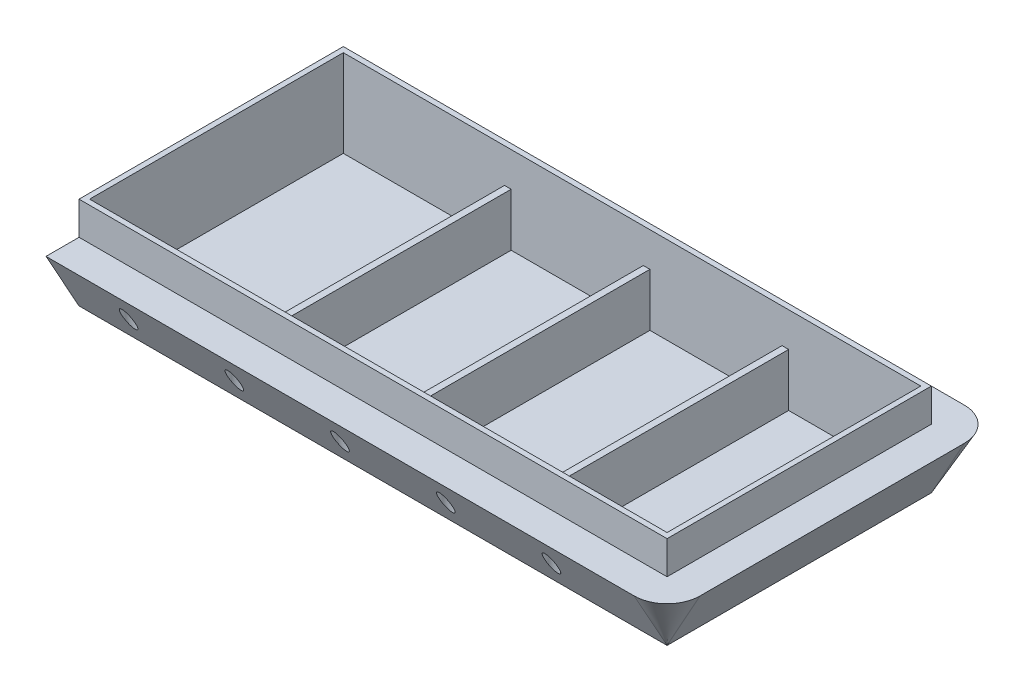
ISO-10303-21;
HEADER;
FILE_DESCRIPTION(('STEP AP214'),'2;1');
FILE_NAME('part.step','',(''),(''),'','','');
FILE_SCHEMA(('AUTOMOTIVE_DESIGN { 1 0 10303 214 1 1 1 1 }'));
ENDSEC;
DATA;
#1=APPLICATION_CONTEXT('core data for automotive mechanical design processes');
#2=APPLICATION_PROTOCOL_DEFINITION('international standard','automotive_design',2000,#1);
#3=PRODUCT_CONTEXT('',#1,'mechanical');
#4=PRODUCT('Part','Part','',(#3));
#5=PRODUCT_RELATED_PRODUCT_CATEGORY('part','',(#4));
#6=PRODUCT_DEFINITION_FORMATION('','',#4);
#7=PRODUCT_DEFINITION_CONTEXT('part definition',#1,'design');
#8=PRODUCT_DEFINITION('design','',#6,#7);
#9=PRODUCT_DEFINITION_SHAPE('','',#8);
#10=(LENGTH_UNIT() NAMED_UNIT(*) SI_UNIT(.MILLI.,.METRE.));
#11=(NAMED_UNIT(*) PLANE_ANGLE_UNIT() SI_UNIT($,.RADIAN.));
#12=(NAMED_UNIT(*) SI_UNIT($,.STERADIAN.) SOLID_ANGLE_UNIT());
#13=UNCERTAINTY_MEASURE_WITH_UNIT(LENGTH_MEASURE(1.E-05),#10,'distance_accuracy_value','');
#14=(GEOMETRIC_REPRESENTATION_CONTEXT(3) GLOBAL_UNCERTAINTY_ASSIGNED_CONTEXT((#13)) GLOBAL_UNIT_ASSIGNED_CONTEXT((#10,
#11,#12)) REPRESENTATION_CONTEXT('',''));
#15=CARTESIAN_POINT('',(0.,0.,0.));
#16=DIRECTION('',(0.,0.,1.));
#17=DIRECTION('',(1.,0.,0.));
#18=AXIS2_PLACEMENT_3D('',#15,#16,#17);
#19=CARTESIAN_POINT('',(-218.5,70.,-96.));
#20=DIRECTION('',(0.,0.,1.));
#21=DIRECTION('',(1.,0.,0.));
#22=AXIS2_PLACEMENT_3D('',#19,#20,#21);
#23=PLANE('',#22);
#24=DIRECTION('',(1.,0.,0.));
#25=VECTOR('',#24,1.);
#26=CARTESIAN_POINT('',(-218.5,4.,-96.));
#27=LINE('',#26,#25);
#28=CARTESIAN_POINT('',(-218.5,4.,-96.));
#29=VERTEX_POINT('',#28);
#30=CARTESIAN_POINT('',(-96.5000000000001,4.,-96.));
#31=VERTEX_POINT('',#30);
#32=EDGE_CURVE('E11',#29,#31,#27,.T.);
#33=ORIENTED_EDGE('',*,*,#32,.T.);
#34=DIRECTION('',(0.,-1.,0.));
#35=VECTOR('',#34,1.);
#36=CARTESIAN_POINT('',(-96.5000000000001,44.,-96.));
#37=LINE('',#36,#35);
#38=CARTESIAN_POINT('',(-96.5000000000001,44.,-96.));
#39=VERTEX_POINT('',#38);
#40=EDGE_CURVE('E61',#39,#31,#37,.T.);
#41=ORIENTED_EDGE('',*,*,#40,.F.);
#42=DIRECTION('',(-1.,0.,0.));
#43=VECTOR('',#42,1.);
#44=CARTESIAN_POINT('',(-96.5000000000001,44.,-96.));
#45=LINE('',#44,#43);
#46=CARTESIAN_POINT('',(-91.5,44.,-96.));
#47=VERTEX_POINT('',#46);
#48=EDGE_CURVE('E65',#47,#39,#45,.T.);
#49=ORIENTED_EDGE('',*,*,#48,.F.);
#50=DIRECTION('',(0.,-1.,0.));
#51=VECTOR('',#50,1.);
#52=CARTESIAN_POINT('',(-91.5000000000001,44.,-96.));
#53=LINE('',#52,#51);
#54=CARTESIAN_POINT('',(-91.5000000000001,4.,-96.));
#55=VERTEX_POINT('',#54);
#56=EDGE_CURVE('E222',#47,#55,#53,.T.);
#57=ORIENTED_EDGE('',*,*,#56,.T.);
#58=CARTESIAN_POINT('',(8.49999999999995,4.00000000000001,-96.));
#59=VERTEX_POINT('',#58);
#60=EDGE_CURVE('E53',#55,#59,#27,.T.);
#61=ORIENTED_EDGE('',*,*,#60,.T.);
#62=DIRECTION('',(0.,-1.,0.));
#63=VECTOR('',#62,1.);
#64=CARTESIAN_POINT('',(8.49999999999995,44.,-96.));
#65=LINE('',#64,#63);
#66=CARTESIAN_POINT('',(8.49999999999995,44.,-96.));
#67=VERTEX_POINT('',#66);
#68=EDGE_CURVE('E263',#67,#59,#65,.T.);
#69=ORIENTED_EDGE('',*,*,#68,.F.);
#70=DIRECTION('',(-1.,0.,0.));
#71=VECTOR('',#70,1.);
#72=CARTESIAN_POINT('',(8.49999999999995,44.,-96.));
#73=LINE('',#72,#71);
#74=CARTESIAN_POINT('',(13.5,44.,-96.));
#75=VERTEX_POINT('',#74);
#76=EDGE_CURVE('E266',#75,#67,#73,.T.);
#77=ORIENTED_EDGE('',*,*,#76,.F.);
#78=DIRECTION('',(0.,-1.,0.));
#79=VECTOR('',#78,1.);
#80=CARTESIAN_POINT('',(13.5,44.,-96.));
#81=LINE('',#80,#79);
#82=CARTESIAN_POINT('',(13.5,4.,-96.));
#83=VERTEX_POINT('',#82);
#84=EDGE_CURVE('E259',#75,#83,#81,.T.);
#85=ORIENTED_EDGE('',*,*,#84,.T.);
#86=CARTESIAN_POINT('',(113.5,4.00000000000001,-96.));
#87=VERTEX_POINT('',#86);
#88=EDGE_CURVE('E220',#83,#87,#27,.T.);
#89=ORIENTED_EDGE('',*,*,#88,.T.);
#90=DIRECTION('',(0.,-1.,0.));
#91=VECTOR('',#90,1.);
#92=CARTESIAN_POINT('',(113.5,44.,-96.));
#93=LINE('',#92,#91);
#94=CARTESIAN_POINT('',(113.5,44.,-96.));
#95=VERTEX_POINT('',#94);
#96=EDGE_CURVE('E306',#95,#87,#93,.T.);
#97=ORIENTED_EDGE('',*,*,#96,.F.);
#98=DIRECTION('',(-1.,0.,0.));
#99=VECTOR('',#98,1.);
#100=CARTESIAN_POINT('',(113.5,44.,-96.));
#101=LINE('',#100,#99);
#102=CARTESIAN_POINT('',(118.5,44.,-96.));
#103=VERTEX_POINT('',#102);
#104=EDGE_CURVE('E302',#103,#95,#101,.T.);
#105=ORIENTED_EDGE('',*,*,#104,.F.);
#106=DIRECTION('',(0.,-1.,0.));
#107=VECTOR('',#106,1.);
#108=CARTESIAN_POINT('',(118.5,44.,-96.));
#109=LINE('',#108,#107);
#110=CARTESIAN_POINT('',(118.5,4.,-96.));
#111=VERTEX_POINT('',#110);
#112=EDGE_CURVE('E316',#103,#111,#109,.T.);
#113=ORIENTED_EDGE('',*,*,#112,.T.);
#114=CARTESIAN_POINT('',(218.5,4.,-96.));
#115=VERTEX_POINT('',#114);
#116=EDGE_CURVE('E55',#111,#115,#27,.T.);
#117=ORIENTED_EDGE('',*,*,#116,.T.);
#118=DIRECTION('',(0.,-1.,0.));
#119=VECTOR('',#118,1.);
#120=CARTESIAN_POINT('',(218.5,70.,-96.));
#121=LINE('',#120,#119);
#122=CARTESIAN_POINT('',(218.5,70.,-96.));
#123=VERTEX_POINT('',#122);
#124=EDGE_CURVE('E457',#123,#115,#121,.T.);
#125=ORIENTED_EDGE('',*,*,#124,.F.);
#126=DIRECTION('',(-1.,0.,0.));
#127=VECTOR('',#126,1.);
#128=CARTESIAN_POINT('',(-218.5,70.,-96.));
#129=LINE('',#128,#127);
#130=CARTESIAN_POINT('',(-218.5,70.,-96.));
#131=VERTEX_POINT('',#130);
#132=EDGE_CURVE('E450',#123,#131,#129,.T.);
#133=ORIENTED_EDGE('',*,*,#132,.T.);
#134=DIRECTION('',(0.,-1.,0.));
#135=VECTOR('',#134,1.);
#136=CARTESIAN_POINT('',(-218.5,70.,-96.));
#137=LINE('',#136,#135);
#138=EDGE_CURVE('E453',#131,#29,#137,.T.);
#139=ORIENTED_EDGE('',*,*,#138,.T.);
#140=EDGE_LOOP('',(#33,#41,#49,#57,#61,#69,#77,#85,#89,#97,#105,#113,#117,#125,#133,#139));
#141=FACE_BOUND('',#140,.T.);
#142=ADVANCED_FACE('F43',(#141),#23,.T.);
#143=CARTESIAN_POINT('',(-218.5,70.,96.));
#144=DIRECTION('',(0.,0.,-1.));
#145=DIRECTION('',(-1.,0.,0.));
#146=AXIS2_PLACEMENT_3D('',#143,#144,#145);
#147=PLANE('',#146);
#148=DIRECTION('',(1.,0.,0.));
#149=VECTOR('',#148,1.);
#150=CARTESIAN_POINT('',(-96.5,44.,96.));
#151=LINE('',#150,#149);
#152=CARTESIAN_POINT('',(-96.5000000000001,44.,96.));
#153=VERTEX_POINT('',#152);
#154=CARTESIAN_POINT('',(-91.5,44.,96.));
#155=VERTEX_POINT('',#154);
#156=EDGE_CURVE('E240',#153,#155,#151,.T.);
#157=ORIENTED_EDGE('',*,*,#156,.F.);
#158=DIRECTION('',(0.,-1.,0.));
#159=VECTOR('',#158,1.);
#160=CARTESIAN_POINT('',(-96.5,44.,96.));
#161=LINE('',#160,#159);
#162=CARTESIAN_POINT('',(-96.5,4.,96.));
#163=VERTEX_POINT('',#162);
#164=EDGE_CURVE('E866',#153,#163,#161,.T.);
#165=ORIENTED_EDGE('',*,*,#164,.T.);
#166=DIRECTION('',(1.,0.,0.));
#167=VECTOR('',#166,1.);
#168=CARTESIAN_POINT('',(-222.5,4.,96.));
#169=LINE('',#168,#167);
#170=CARTESIAN_POINT('',(-218.5,4.,96.));
#171=VERTEX_POINT('',#170);
#172=EDGE_CURVE('E427',#171,#163,#169,.T.);
#173=ORIENTED_EDGE('',*,*,#172,.F.);
#174=DIRECTION('',(0.,-1.,0.));
#175=VECTOR('',#174,1.);
#176=CARTESIAN_POINT('',(-218.5,70.,96.));
#177=LINE('',#176,#175);
#178=CARTESIAN_POINT('',(-218.5,70.,96.));
#179=VERTEX_POINT('',#178);
#180=EDGE_CURVE('E465',#179,#171,#177,.T.);
#181=ORIENTED_EDGE('',*,*,#180,.F.);
#182=DIRECTION('',(1.,0.,0.));
#183=VECTOR('',#182,1.);
#184=CARTESIAN_POINT('',(-218.5,70.,96.));
#185=LINE('',#184,#183);
#186=CARTESIAN_POINT('',(218.5,70.,96.));
#187=VERTEX_POINT('',#186);
#188=EDGE_CURVE('E443',#179,#187,#185,.T.);
#189=ORIENTED_EDGE('',*,*,#188,.T.);
#190=DIRECTION('',(0.,-1.,0.));
#191=VECTOR('',#190,1.);
#192=CARTESIAN_POINT('',(218.5,70.,96.));
#193=LINE('',#192,#191);
#194=CARTESIAN_POINT('',(218.5,4.,96.));
#195=VERTEX_POINT('',#194);
#196=EDGE_CURVE('E461',#187,#195,#193,.T.);
#197=ORIENTED_EDGE('',*,*,#196,.T.);
#198=CARTESIAN_POINT('',(118.5,4.,96.));
#199=VERTEX_POINT('',#198);
#200=EDGE_CURVE('E426',#199,#195,#169,.T.);
#201=ORIENTED_EDGE('',*,*,#200,.F.);
#202=DIRECTION('',(0.,-1.,0.));
#203=VECTOR('',#202,1.);
#204=CARTESIAN_POINT('',(118.5,44.,96.));
#205=LINE('',#204,#203);
#206=CARTESIAN_POINT('',(118.5,44.,96.));
#207=VERTEX_POINT('',#206);
#208=EDGE_CURVE('E320',#207,#199,#205,.T.);
#209=ORIENTED_EDGE('',*,*,#208,.F.);
#210=DIRECTION('',(1.,0.,0.));
#211=VECTOR('',#210,1.);
#212=CARTESIAN_POINT('',(113.5,44.,96.));
#213=LINE('',#212,#211);
#214=CARTESIAN_POINT('',(113.5,44.,96.));
#215=VERTEX_POINT('',#214);
#216=EDGE_CURVE('E293',#215,#207,#213,.T.);
#217=ORIENTED_EDGE('',*,*,#216,.F.);
#218=DIRECTION('',(0.,-1.,0.));
#219=VECTOR('',#218,1.);
#220=CARTESIAN_POINT('',(113.5,44.,96.));
#221=LINE('',#220,#219);
#222=CARTESIAN_POINT('',(113.5,4.,96.));
#223=VERTEX_POINT('',#222);
#224=EDGE_CURVE('E324',#215,#223,#221,.T.);
#225=ORIENTED_EDGE('',*,*,#224,.T.);
#226=CARTESIAN_POINT('',(13.5,4.,96.));
#227=VERTEX_POINT('',#226);
#228=EDGE_CURVE('E628',#227,#223,#169,.T.);
#229=ORIENTED_EDGE('',*,*,#228,.F.);
#230=DIRECTION('',(0.,-1.,0.));
#231=VECTOR('',#230,1.);
#232=CARTESIAN_POINT('',(13.5,44.,96.));
#233=LINE('',#232,#231);
#234=CARTESIAN_POINT('',(13.5,44.,96.));
#235=VERTEX_POINT('',#234);
#236=EDGE_CURVE('E255',#235,#227,#233,.T.);
#237=ORIENTED_EDGE('',*,*,#236,.F.);
#238=DIRECTION('',(1.,0.,0.));
#239=VECTOR('',#238,1.);
#240=CARTESIAN_POINT('',(8.49999999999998,44.,96.));
#241=LINE('',#240,#239);
#242=CARTESIAN_POINT('',(8.49999999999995,44.,96.));
#243=VERTEX_POINT('',#242);
#244=EDGE_CURVE('E282',#243,#235,#241,.T.);
#245=ORIENTED_EDGE('',*,*,#244,.F.);
#246=DIRECTION('',(0.,-1.,0.));
#247=VECTOR('',#246,1.);
#248=CARTESIAN_POINT('',(8.49999999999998,44.,96.));
#249=LINE('',#248,#247);
#250=CARTESIAN_POINT('',(8.49999999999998,4.,96.));
#251=VERTEX_POINT('',#250);
#252=EDGE_CURVE('E237',#243,#251,#249,.T.);
#253=ORIENTED_EDGE('',*,*,#252,.T.);
#254=CARTESIAN_POINT('',(-91.5000000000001,4.,96.));
#255=VERTEX_POINT('',#254);
#256=EDGE_CURVE('E432',#255,#251,#169,.T.);
#257=ORIENTED_EDGE('',*,*,#256,.F.);
#258=DIRECTION('',(0.,-1.,0.));
#259=VECTOR('',#258,1.);
#260=CARTESIAN_POINT('',(-91.5,44.,96.));
#261=LINE('',#260,#259);
#262=EDGE_CURVE('E226',#155,#255,#261,.T.);
#263=ORIENTED_EDGE('',*,*,#262,.F.);
#264=EDGE_LOOP('',(#157,#165,#173,#181,#189,#197,#201,#209,#217,#225,#229,#237,#245,#253,#257,#263));
#265=FACE_BOUND('',#264,.T.);
#266=ADVANCED_FACE('F619',(#265),#147,.T.);
#267=CARTESIAN_POINT('',(-222.5,4.,541.017977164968));
#268=DIRECTION('',(0.,-1.,0.));
#269=DIRECTION('',(1.,0.,0.));
#270=AXIS2_PLACEMENT_3D('',#267,#268,#269);
#271=PLANE('',#270);
#272=DIRECTION('',(0.,0.,1.));
#273=VECTOR('',#272,1.);
#274=CARTESIAN_POINT('',(-96.5000000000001,4.,-96.));
#275=LINE('',#274,#273);
#276=EDGE_CURVE('E231',#31,#163,#275,.T.);
#277=ORIENTED_EDGE('',*,*,#276,.F.);
#278=ORIENTED_EDGE('',*,*,#32,.F.);
#279=DIRECTION('',(0.,0.,-1.));
#280=VECTOR('',#279,1.);
#281=CARTESIAN_POINT('',(-218.5,4.,-96.));
#282=LINE('',#281,#280);
#283=EDGE_CURVE('E436',#171,#29,#282,.T.);
#284=ORIENTED_EDGE('',*,*,#283,.F.);
#285=ORIENTED_EDGE('',*,*,#172,.T.);
#286=EDGE_LOOP('',(#277,#278,#284,#285));
#287=FACE_BOUND('',#286,.T.);
#288=ADVANCED_FACE('F670',(#287),#271,.F.);
#289=DIRECTION('',(0.,0.,-1.));
#290=VECTOR('',#289,1.);
#291=CARTESIAN_POINT('',(-91.5000000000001,4.,-96.));
#292=LINE('',#291,#290);
#293=EDGE_CURVE('E214',#255,#55,#292,.T.);
#294=ORIENTED_EDGE('',*,*,#293,.F.);
#295=ORIENTED_EDGE('',*,*,#256,.T.);
#296=DIRECTION('',(0.,0.,1.));
#297=VECTOR('',#296,1.);
#298=CARTESIAN_POINT('',(8.49999999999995,4.,-96.));
#299=LINE('',#298,#297);
#300=EDGE_CURVE('E217',#59,#251,#299,.T.);
#301=ORIENTED_EDGE('',*,*,#300,.F.);
#302=ORIENTED_EDGE('',*,*,#60,.F.);
#303=EDGE_LOOP('',(#294,#295,#301,#302));
#304=FACE_BOUND('',#303,.T.);
#305=ADVANCED_FACE('F212',(#304),#271,.F.);
#306=DIRECTION('',(0.,0.,-1.));
#307=VECTOR('',#306,1.);
#308=CARTESIAN_POINT('',(13.5,4.,-96.));
#309=LINE('',#308,#307);
#310=EDGE_CURVE('E267',#227,#83,#309,.T.);
#311=ORIENTED_EDGE('',*,*,#310,.F.);
#312=ORIENTED_EDGE('',*,*,#228,.T.);
#313=DIRECTION('',(0.,0.,1.));
#314=VECTOR('',#313,1.);
#315=CARTESIAN_POINT('',(113.5,4.,-96.));
#316=LINE('',#315,#314);
#317=EDGE_CURVE('E274',#87,#223,#316,.T.);
#318=ORIENTED_EDGE('',*,*,#317,.F.);
#319=ORIENTED_EDGE('',*,*,#88,.F.);
#320=EDGE_LOOP('',(#311,#312,#318,#319));
#321=FACE_BOUND('',#320,.T.);
#322=ADVANCED_FACE('F645',(#321),#271,.F.);
#323=DIRECTION('',(0.,0.,-1.));
#324=VECTOR('',#323,1.);
#325=CARTESIAN_POINT('',(118.5,4.,-96.));
#326=LINE('',#325,#324);
#327=EDGE_CURVE('E294',#199,#111,#326,.T.);
#328=ORIENTED_EDGE('',*,*,#327,.F.);
#329=ORIENTED_EDGE('',*,*,#200,.T.);
#330=DIRECTION('',(0.,0.,1.));
#331=VECTOR('',#330,1.);
#332=CARTESIAN_POINT('',(218.5,4.,-96.));
#333=LINE('',#332,#331);
#334=EDGE_CURVE('E431',#115,#195,#333,.T.);
#335=ORIENTED_EDGE('',*,*,#334,.F.);
#336=ORIENTED_EDGE('',*,*,#116,.F.);
#337=EDGE_LOOP('',(#328,#329,#335,#336));
#338=FACE_BOUND('',#337,.T.);
#339=ADVANCED_FACE('F626',(#338),#271,.F.);
#340=CARTESIAN_POINT('',(218.5,70.,-96.));
#341=DIRECTION('',(-1.,0.,0.));
#342=DIRECTION('',(0.,0.,1.));
#343=AXIS2_PLACEMENT_3D('',#340,#341,#342);
#344=PLANE('',#343);
#345=ORIENTED_EDGE('',*,*,#124,.T.);
#346=ORIENTED_EDGE('',*,*,#334,.T.);
#347=ORIENTED_EDGE('',*,*,#196,.F.);
#348=DIRECTION('',(0.,0.,-1.));
#349=VECTOR('',#348,1.);
#350=CARTESIAN_POINT('',(218.5,70.,-96.));
#351=LINE('',#350,#349);
#352=EDGE_CURVE('E446',#187,#123,#351,.T.);
#353=ORIENTED_EDGE('',*,*,#352,.T.);
#354=EDGE_LOOP('',(#345,#346,#347,#353));
#355=FACE_BOUND('',#354,.T.);
#356=ADVANCED_FACE('F623',(#355),#344,.T.);
#357=CARTESIAN_POINT('',(222.5,70.,-100.));
#358=DIRECTION('',(-1.,0.,0.));
#359=DIRECTION('',(0.,0.,1.));
#360=AXIS2_PLACEMENT_3D('',#357,#358,#359);
#361=PLANE('',#360);
#362=DIRECTION('',(0.,0.,1.));
#363=VECTOR('',#362,1.);
#364=CARTESIAN_POINT('',(222.5,45.,-151.478150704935));
#365=LINE('',#364,#363);
#366=CARTESIAN_POINT('',(222.5,45.,-100.));
#367=VERTEX_POINT('',#366);
#368=CARTESIAN_POINT('',(222.5,45.,100.));
#369=VERTEX_POINT('',#368);
#370=EDGE_CURVE('E342',#367,#369,#365,.T.);
#371=ORIENTED_EDGE('',*,*,#370,.F.);
#372=DIRECTION('',(0.,-1.,0.));
#373=VECTOR('',#372,1.);
#374=CARTESIAN_POINT('',(222.5,70.,-100.));
#375=LINE('',#374,#373);
#376=CARTESIAN_POINT('',(222.5,70.,-100.));
#377=VERTEX_POINT('',#376);
#378=EDGE_CURVE('E508',#377,#367,#375,.T.);
#379=ORIENTED_EDGE('',*,*,#378,.F.);
#380=DIRECTION('',(0.,0.,-1.));
#381=VECTOR('',#380,1.);
#382=CARTESIAN_POINT('',(222.5,70.,-100.));
#383=LINE('',#382,#381);
#384=CARTESIAN_POINT('',(222.5,70.,100.));
#385=VERTEX_POINT('',#384);
#386=EDGE_CURVE('E470',#385,#377,#383,.T.);
#387=ORIENTED_EDGE('',*,*,#386,.F.);
#388=DIRECTION('',(0.,-1.,0.));
#389=VECTOR('',#388,1.);
#390=CARTESIAN_POINT('',(222.5,70.,100.));
#391=LINE('',#390,#389);
#392=EDGE_CURVE('E484',#385,#369,#391,.T.);
#393=ORIENTED_EDGE('',*,*,#392,.T.);
#394=EDGE_LOOP('',(#371,#379,#387,#393));
#395=FACE_BOUND('',#394,.T.);
#396=ADVANCED_FACE('F45',(#395),#361,.F.);
#397=CARTESIAN_POINT('',(-222.5,70.,100.));
#398=DIRECTION('',(0.,0.,-1.));
#399=DIRECTION('',(-1.,0.,0.));
#400=AXIS2_PLACEMENT_3D('',#397,#398,#399);
#401=PLANE('',#400);
#402=DIRECTION('',(-1.,0.,0.));
#403=VECTOR('',#402,1.);
#404=CARTESIAN_POINT('',(273.978150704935,45.,100.));
#405=LINE('',#404,#403);
#406=CARTESIAN_POINT('',(-222.5,45.,100.));
#407=VERTEX_POINT('',#406);
#408=EDGE_CURVE('E417',#369,#407,#405,.T.);
#409=ORIENTED_EDGE('',*,*,#408,.F.);
#410=ORIENTED_EDGE('',*,*,#392,.F.);
#411=DIRECTION('',(1.,0.,0.));
#412=VECTOR('',#411,1.);
#413=CARTESIAN_POINT('',(-222.5,70.,100.));
#414=LINE('',#413,#412);
#415=CARTESIAN_POINT('',(-222.5,70.,100.));
#416=VERTEX_POINT('',#415);
#417=EDGE_CURVE('E481',#416,#385,#414,.T.);
#418=ORIENTED_EDGE('',*,*,#417,.F.);
#419=DIRECTION('',(0.,-1.,0.));
#420=VECTOR('',#419,1.);
#421=CARTESIAN_POINT('',(-222.5,70.,100.));
#422=LINE('',#421,#420);
#423=EDGE_CURVE('E500',#416,#407,#422,.T.);
#424=ORIENTED_EDGE('',*,*,#423,.T.);
#425=EDGE_LOOP('',(#409,#410,#418,#424));
#426=FACE_BOUND('',#425,.T.);
#427=ADVANCED_FACE('F604',(#426),#401,.F.);
#428=CARTESIAN_POINT('',(-218.5,70.,-96.));
#429=DIRECTION('',(1.,0.,0.));
#430=DIRECTION('',(0.,0.,-1.));
#431=AXIS2_PLACEMENT_3D('',#428,#429,#430);
#432=PLANE('',#431);
#433=ORIENTED_EDGE('',*,*,#180,.T.);
#434=ORIENTED_EDGE('',*,*,#283,.T.);
#435=ORIENTED_EDGE('',*,*,#138,.F.);
#436=DIRECTION('',(0.,0.,1.));
#437=VECTOR('',#436,1.);
#438=CARTESIAN_POINT('',(-218.5,70.,-96.));
#439=LINE('',#438,#437);
#440=EDGE_CURVE('E440',#131,#179,#439,.T.);
#441=ORIENTED_EDGE('',*,*,#440,.T.);
#442=EDGE_LOOP('',(#433,#434,#435,#441));
#443=FACE_BOUND('',#442,.T.);
#444=ADVANCED_FACE('F610',(#443),#432,.T.);
#445=CARTESIAN_POINT('',(0.,70.,0.));
#446=DIRECTION('',(0.,1.,0.));
#447=DIRECTION('',(0.,0.,1.));
#448=AXIS2_PLACEMENT_3D('',#445,#446,#447);
#449=PLANE('',#448);
#450=ORIENTED_EDGE('',*,*,#386,.T.);
#451=DIRECTION('',(-1.,0.,0.));
#452=VECTOR('',#451,1.);
#453=CARTESIAN_POINT('',(-222.5,70.,-100.));
#454=LINE('',#453,#452);
#455=CARTESIAN_POINT('',(-222.5,70.,-100.));
#456=VERTEX_POINT('',#455);
#457=EDGE_CURVE('E474',#377,#456,#454,.T.);
#458=ORIENTED_EDGE('',*,*,#457,.T.);
#459=DIRECTION('',(0.,0.,1.));
#460=VECTOR('',#459,1.);
#461=CARTESIAN_POINT('',(-222.5,70.,-100.));
#462=LINE('',#461,#460);
#463=EDGE_CURVE('E478',#456,#416,#462,.T.);
#464=ORIENTED_EDGE('',*,*,#463,.T.);
#465=ORIENTED_EDGE('',*,*,#417,.T.);
#466=EDGE_LOOP('',(#450,#458,#464,#465));
#467=FACE_BOUND('',#466,.T.);
#468=ORIENTED_EDGE('',*,*,#188,.F.);
#469=ORIENTED_EDGE('',*,*,#440,.F.);
#470=ORIENTED_EDGE('',*,*,#132,.F.);
#471=ORIENTED_EDGE('',*,*,#352,.F.);
#472=EDGE_LOOP('',(#468,#469,#470,#471));
#473=FACE_BOUND('',#472,.T.);
#474=ADVANCED_FACE('F607',(#467,#473),#449,.T.);
#475=CARTESIAN_POINT('',(0.,0.,0.));
#476=DIRECTION('',(0.,1.,0.));
#477=DIRECTION('',(0.,0.,1.));
#478=AXIS2_PLACEMENT_3D('',#475,#476,#477);
#479=PLANE('',#478);
#480=DIRECTION('',(1.,0.,0.));
#481=VECTOR('',#480,1.);
#482=CARTESIAN_POINT('',(-222.5,0.,100.));
#483=LINE('',#482,#481);
#484=CARTESIAN_POINT('',(-222.5,0.,100.));
#485=VERTEX_POINT('',#484);
#486=CARTESIAN_POINT('',(222.5,0.,100.));
#487=VERTEX_POINT('',#486);
#488=EDGE_CURVE('E475',#485,#487,#483,.T.);
#489=ORIENTED_EDGE('',*,*,#488,.F.);
#490=DIRECTION('',(0.,0.,1.));
#491=VECTOR('',#490,1.);
#492=CARTESIAN_POINT('',(-222.5,0.,-100.));
#493=LINE('',#492,#491);
#494=CARTESIAN_POINT('',(-222.5,0.,-100.));
#495=VERTEX_POINT('',#494);
#496=EDGE_CURVE('E491',#495,#485,#493,.T.);
#497=ORIENTED_EDGE('',*,*,#496,.F.);
#498=DIRECTION('',(-1.,0.,0.));
#499=VECTOR('',#498,1.);
#500=CARTESIAN_POINT('',(-222.5,0.,-100.));
#501=LINE('',#500,#499);
#502=CARTESIAN_POINT('',(222.5,0.,-100.));
#503=VERTEX_POINT('',#502);
#504=EDGE_CURVE('E488',#503,#495,#501,.T.);
#505=ORIENTED_EDGE('',*,*,#504,.F.);
#506=DIRECTION('',(0.,0.,-1.));
#507=VECTOR('',#506,1.);
#508=CARTESIAN_POINT('',(222.5,0.,-100.));
#509=LINE('',#508,#507);
#510=EDGE_CURVE('E469',#487,#503,#509,.T.);
#511=ORIENTED_EDGE('',*,*,#510,.F.);
#512=EDGE_LOOP('',(#489,#497,#505,#511));
#513=FACE_BOUND('',#512,.T.);
#514=ADVANCED_FACE('F588',(#513),#479,.F.);
#515=CARTESIAN_POINT('',(-222.5,70.,-100.));
#516=DIRECTION('',(0.,0.,1.));
#517=DIRECTION('',(1.,0.,0.));
#518=AXIS2_PLACEMENT_3D('',#515,#516,#517);
#519=PLANE('',#518);
#520=ORIENTED_EDGE('',*,*,#378,.T.);
#521=DIRECTION('',(-1.,0.,0.));
#522=VECTOR('',#521,1.);
#523=CARTESIAN_POINT('',(273.978150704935,45.,-100.));
#524=LINE('',#523,#522);
#525=CARTESIAN_POINT('',(-222.5,45.,-100.));
#526=VERTEX_POINT('',#525);
#527=EDGE_CURVE('E404',#367,#526,#524,.T.);
#528=ORIENTED_EDGE('',*,*,#527,.T.);
#529=DIRECTION('',(0.,-1.,0.));
#530=VECTOR('',#529,1.);
#531=CARTESIAN_POINT('',(-222.5,70.,-100.));
#532=LINE('',#531,#530);
#533=EDGE_CURVE('E504',#456,#526,#532,.T.);
#534=ORIENTED_EDGE('',*,*,#533,.F.);
#535=ORIENTED_EDGE('',*,*,#457,.F.);
#536=EDGE_LOOP('',(#520,#528,#534,#535));
#537=FACE_BOUND('',#536,.T.);
#538=ADVANCED_FACE('F599',(#537),#519,.F.);
#539=CARTESIAN_POINT('',(-222.5,70.,-100.));
#540=DIRECTION('',(1.,0.,0.));
#541=DIRECTION('',(0.,0.,-1.));
#542=AXIS2_PLACEMENT_3D('',#539,#540,#541);
#543=PLANE('',#542);
#544=ORIENTED_EDGE('',*,*,#496,.T.);
#545=DIRECTION('',(0.,0.874157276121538,0.485642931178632));
#546=VECTOR('',#545,1.);
#547=CARTESIAN_POINT('',(-222.5,45.,125.));
#548=LINE('',#547,#546);
#549=CARTESIAN_POINT('',(-222.5,45.,125.));
#550=VERTEX_POINT('',#549);
#551=EDGE_CURVE('E394',#485,#550,#548,.T.);
#552=ORIENTED_EDGE('',*,*,#551,.T.);
#553=DIRECTION('',(0.,0.,-1.));
#554=VECTOR('',#553,1.);
#555=CARTESIAN_POINT('',(-222.5,45.,100.));
#556=LINE('',#555,#554);
#557=EDGE_CURVE('E412',#550,#407,#556,.T.);
#558=ORIENTED_EDGE('',*,*,#557,.T.);
#559=ORIENTED_EDGE('',*,*,#423,.F.);
#560=ORIENTED_EDGE('',*,*,#463,.F.);
#561=ORIENTED_EDGE('',*,*,#533,.T.);
#562=DIRECTION('',(0.,0.,1.));
#563=VECTOR('',#562,1.);
#564=CARTESIAN_POINT('',(-222.5,45.,-100.));
#565=LINE('',#564,#563);
#566=CARTESIAN_POINT('',(-222.5,45.,-125.));
#567=VERTEX_POINT('',#566);
#568=EDGE_CURVE('E396',#567,#526,#565,.T.);
#569=ORIENTED_EDGE('',*,*,#568,.F.);
#570=DIRECTION('',(0.,0.874157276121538,-0.485642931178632));
#571=VECTOR('',#570,1.);
#572=CARTESIAN_POINT('',(-222.5,45.,-125.));
#573=LINE('',#572,#571);
#574=EDGE_CURVE('E400',#495,#567,#573,.T.);
#575=ORIENTED_EDGE('',*,*,#574,.F.);
#576=EDGE_LOOP('',(#544,#552,#558,#559,#560,#561,#569,#575));
#577=FACE_BOUND('',#576,.T.);
#578=ADVANCED_FACE('F580',(#577),#543,.F.);
#579=CARTESIAN_POINT('',(273.978150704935,45.,100.));
#580=DIRECTION('',(0.,1.,0.));
#581=DIRECTION('',(0.,0.,1.));
#582=AXIS2_PLACEMENT_3D('',#579,#580,#581);
#583=PLANE('',#582);
#584=DIRECTION('',(0.,0.,1.));
#585=VECTOR('',#584,1.);
#586=CARTESIAN_POINT('',(247.5,45.,-151.478150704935));
#587=LINE('',#586,#585);
#588=CARTESIAN_POINT('',(247.5,45.,-100.));
#589=VERTEX_POINT('',#588);
#590=CARTESIAN_POINT('',(247.5,45.,100.));
#591=VERTEX_POINT('',#590);
#592=EDGE_CURVE('E346',#589,#591,#587,.T.);
#593=ORIENTED_EDGE('',*,*,#592,.F.);
#594=CARTESIAN_POINT('',(222.5,45.,-100.));
#595=DIRECTION('',(0.,1.,0.));
#596=DIRECTION('',(0.,0.,1.));
#597=AXIS2_PLACEMENT_3D('',#594,#595,#596);
#598=CIRCLE('',#597,25.);
#599=CARTESIAN_POINT('',(222.5,45.,-125.));
#600=VERTEX_POINT('',#599);
#601=EDGE_CURVE('E328',#589,#600,#598,.T.);
#602=ORIENTED_EDGE('',*,*,#601,.T.);
#603=DIRECTION('',(-1.,0.,0.));
#604=VECTOR('',#603,1.);
#605=CARTESIAN_POINT('',(273.978150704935,45.,-125.));
#606=LINE('',#605,#604);
#607=EDGE_CURVE('E395',#600,#567,#606,.T.);
#608=ORIENTED_EDGE('',*,*,#607,.T.);
#609=ORIENTED_EDGE('',*,*,#568,.T.);
#610=ORIENTED_EDGE('',*,*,#527,.F.);
#611=ORIENTED_EDGE('',*,*,#370,.T.);
#612=ORIENTED_EDGE('',*,*,#408,.T.);
#613=ORIENTED_EDGE('',*,*,#557,.F.);
#614=DIRECTION('',(-1.,0.,0.));
#615=VECTOR('',#614,1.);
#616=CARTESIAN_POINT('',(273.978150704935,45.,125.));
#617=LINE('',#616,#615);
#618=CARTESIAN_POINT('',(222.5,45.,125.));
#619=VERTEX_POINT('',#618);
#620=EDGE_CURVE('E416',#619,#550,#617,.T.);
#621=ORIENTED_EDGE('',*,*,#620,.F.);
#622=CARTESIAN_POINT('',(222.5,45.,100.));
#623=DIRECTION('',(0.,-1.,0.));
#624=DIRECTION('',(0.,0.,-1.));
#625=AXIS2_PLACEMENT_3D('',#622,#623,#624);
#626=CIRCLE('',#625,25.);
#627=EDGE_CURVE('E332',#591,#619,#626,.T.);
#628=ORIENTED_EDGE('',*,*,#627,.F.);
#629=EDGE_LOOP('',(#593,#602,#608,#609,#610,#611,#612,#613,#621,#628));
#630=FACE_BOUND('',#629,.T.);
#631=ADVANCED_FACE('F558',(#630),#583,.T.);
#632=CARTESIAN_POINT('',(273.978150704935,45.,125.));
#633=DIRECTION('',(0.,-0.485642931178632,0.874157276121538));
#634=DIRECTION('',(0.,-0.874157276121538,-0.485642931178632));
#635=AXIS2_PLACEMENT_3D('',#632,#633,#634);
#636=PLANE('',#635);
#637=CARTESIAN_POINT('',(147.5,22.4999999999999,112.5));
#638=DIRECTION('',(0.,-0.485642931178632,0.874157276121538));
#639=DIRECTION('',(0.,0.874157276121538,0.485642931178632));
#640=AXIS2_PLACEMENT_3D('',#637,#638,#639);
#641=ELLIPSE('',#640,10.295630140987,4.99999999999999);
#642=CARTESIAN_POINT('',(147.5,31.4999999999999,117.5));
#643=VERTEX_POINT('',#642);
#644=EDGE_CURVE('E47',#643,#643,#641,.T.);
#645=ORIENTED_EDGE('',*,*,#644,.F.);
#646=EDGE_LOOP('',(#645));
#647=FACE_BOUND('',#646,.T.);
#648=CARTESIAN_POINT('',(67.4999999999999,22.4999999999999,112.5));
#649=DIRECTION('',(0.,-0.485642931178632,0.874157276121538));
#650=DIRECTION('',(0.,0.874157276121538,0.485642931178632));
#651=AXIS2_PLACEMENT_3D('',#648,#649,#650);
#652=ELLIPSE('',#651,10.295630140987,4.99999999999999);
#653=CARTESIAN_POINT('',(67.4999999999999,31.4999999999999,117.5));
#654=VERTEX_POINT('',#653);
#655=EDGE_CURVE('E542',#654,#654,#652,.T.);
#656=ORIENTED_EDGE('',*,*,#655,.F.);
#657=EDGE_LOOP('',(#656));
#658=FACE_BOUND('',#657,.T.);
#659=CARTESIAN_POINT('',(-12.5,22.4999999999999,112.5));
#660=DIRECTION('',(0.,-0.485642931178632,0.874157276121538));
#661=DIRECTION('',(0.,0.874157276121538,0.485642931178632));
#662=AXIS2_PLACEMENT_3D('',#659,#660,#661);
#663=ELLIPSE('',#662,10.295630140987,4.99999999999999);
#664=CARTESIAN_POINT('',(-12.5,31.4999999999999,117.5));
#665=VERTEX_POINT('',#664);
#666=EDGE_CURVE('E539',#665,#665,#663,.T.);
#667=ORIENTED_EDGE('',*,*,#666,.F.);
#668=EDGE_LOOP('',(#667));
#669=FACE_BOUND('',#668,.T.);
#670=CARTESIAN_POINT('',(-172.5,22.4999999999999,112.5));
#671=DIRECTION('',(0.,-0.485642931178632,0.874157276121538));
#672=DIRECTION('',(0.,0.874157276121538,0.485642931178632));
#673=AXIS2_PLACEMENT_3D('',#670,#671,#672);
#674=ELLIPSE('',#673,10.295630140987,4.99999999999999);
#675=CARTESIAN_POINT('',(-172.5,31.4999999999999,117.5));
#676=VERTEX_POINT('',#675);
#677=EDGE_CURVE('E535',#676,#676,#674,.T.);
#678=ORIENTED_EDGE('',*,*,#677,.F.);
#679=EDGE_LOOP('',(#678));
#680=FACE_BOUND('',#679,.T.);
#681=CARTESIAN_POINT('',(-92.5,22.4999999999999,112.5));
#682=DIRECTION('',(0.,-0.485642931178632,0.874157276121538));
#683=DIRECTION('',(0.,0.874157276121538,0.485642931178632));
#684=AXIS2_PLACEMENT_3D('',#681,#682,#683);
#685=ELLIPSE('',#684,10.295630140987,4.99999999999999);
#686=CARTESIAN_POINT('',(-92.5,31.4999999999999,117.5));
#687=VERTEX_POINT('',#686);
#688=EDGE_CURVE('E531',#687,#687,#685,.T.);
#689=ORIENTED_EDGE('',*,*,#688,.F.);
#690=EDGE_LOOP('',(#689));
#691=FACE_BOUND('',#690,.T.);
#692=DIRECTION('',(0.,-0.874157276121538,-0.485642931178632));
#693=VECTOR('',#692,1.);
#694=CARTESIAN_POINT('',(222.5,45.,125.));
#695=LINE('',#694,#693);
#696=EDGE_CURVE('E420',#619,#487,#695,.T.);
#697=ORIENTED_EDGE('',*,*,#696,.F.);
#698=ORIENTED_EDGE('',*,*,#620,.T.);
#699=ORIENTED_EDGE('',*,*,#551,.F.);
#700=ORIENTED_EDGE('',*,*,#488,.T.);
#701=EDGE_LOOP('',(#697,#698,#699,#700));
#702=FACE_BOUND('',#701,.T.);
#703=ADVANCED_FACE('F554',(#647,#658,#669,#680,#691,#702),#636,.T.);
#704=CARTESIAN_POINT('',(273.978150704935,45.,-125.));
#705=DIRECTION('',(0.,0.485642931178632,0.874157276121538));
#706=DIRECTION('',(0.,-0.874157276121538,0.485642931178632));
#707=AXIS2_PLACEMENT_3D('',#704,#705,#706);
#708=PLANE('',#707);
#709=CARTESIAN_POINT('',(-92.5,22.4999999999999,-112.5));
#710=DIRECTION('',(0.,0.485642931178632,0.874157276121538));
#711=DIRECTION('',(0.,0.874157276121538,-0.485642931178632));
#712=AXIS2_PLACEMENT_3D('',#709,#710,#711);
#713=ELLIPSE('',#712,10.295630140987,4.99999999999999);
#714=CARTESIAN_POINT('',(-92.5,31.4999999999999,-117.5));
#715=VERTEX_POINT('',#714);
#716=EDGE_CURVE('E527',#715,#715,#713,.T.);
#717=ORIENTED_EDGE('',*,*,#716,.T.);
#718=EDGE_LOOP('',(#717));
#719=FACE_BOUND('',#718,.T.);
#720=CARTESIAN_POINT('',(-12.5,22.4999999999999,-112.5));
#721=DIRECTION('',(0.,0.485642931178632,0.874157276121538));
#722=DIRECTION('',(0.,0.874157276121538,-0.485642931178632));
#723=AXIS2_PLACEMENT_3D('',#720,#721,#722);
#724=ELLIPSE('',#723,10.295630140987,4.99999999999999);
#725=CARTESIAN_POINT('',(-12.5,31.4999999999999,-117.5));
#726=VERTEX_POINT('',#725);
#727=EDGE_CURVE('E523',#726,#726,#724,.T.);
#728=ORIENTED_EDGE('',*,*,#727,.T.);
#729=EDGE_LOOP('',(#728));
#730=FACE_BOUND('',#729,.T.);
#731=CARTESIAN_POINT('',(67.4999999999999,22.4999999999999,-112.5));
#732=DIRECTION('',(0.,0.485642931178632,0.874157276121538));
#733=DIRECTION('',(0.,0.874157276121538,-0.485642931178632));
#734=AXIS2_PLACEMENT_3D('',#731,#732,#733);
#735=ELLIPSE('',#734,10.295630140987,4.99999999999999);
#736=CARTESIAN_POINT('',(67.4999999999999,31.4999999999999,-117.5));
#737=VERTEX_POINT('',#736);
#738=EDGE_CURVE('E519',#737,#737,#735,.T.);
#739=ORIENTED_EDGE('',*,*,#738,.T.);
#740=EDGE_LOOP('',(#739));
#741=FACE_BOUND('',#740,.T.);
#742=CARTESIAN_POINT('',(147.5,22.4999999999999,-112.5));
#743=DIRECTION('',(0.,0.485642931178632,0.874157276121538));
#744=DIRECTION('',(0.,0.874157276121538,-0.485642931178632));
#745=AXIS2_PLACEMENT_3D('',#742,#743,#744);
#746=ELLIPSE('',#745,10.295630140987,4.99999999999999);
#747=CARTESIAN_POINT('',(147.5,31.4999999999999,-117.5));
#748=VERTEX_POINT('',#747);
#749=EDGE_CURVE('E515',#748,#748,#746,.T.);
#750=ORIENTED_EDGE('',*,*,#749,.T.);
#751=EDGE_LOOP('',(#750));
#752=FACE_BOUND('',#751,.T.);
#753=CARTESIAN_POINT('',(-172.5,22.4999999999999,-112.5));
#754=DIRECTION('',(0.,0.485642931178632,0.874157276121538));
#755=DIRECTION('',(0.,0.874157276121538,-0.485642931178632));
#756=AXIS2_PLACEMENT_3D('',#753,#754,#755);
#757=ELLIPSE('',#756,10.295630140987,4.99999999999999);
#758=CARTESIAN_POINT('',(-172.5,31.4999999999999,-117.5));
#759=VERTEX_POINT('',#758);
#760=EDGE_CURVE('E390',#759,#759,#757,.T.);
#761=ORIENTED_EDGE('',*,*,#760,.T.);
#762=EDGE_LOOP('',(#761));
#763=FACE_BOUND('',#762,.T.);
#764=ORIENTED_EDGE('',*,*,#607,.F.);
#765=DIRECTION('',(0.,-0.874157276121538,0.485642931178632));
#766=VECTOR('',#765,1.);
#767=CARTESIAN_POINT('',(222.5,45.,-125.));
#768=LINE('',#767,#766);
#769=EDGE_CURVE('E391',#600,#503,#768,.T.);
#770=ORIENTED_EDGE('',*,*,#769,.T.);
#771=ORIENTED_EDGE('',*,*,#504,.T.);
#772=ORIENTED_EDGE('',*,*,#574,.T.);
#773=EDGE_LOOP('',(#764,#770,#771,#772));
#774=FACE_BOUND('',#773,.T.);
#775=ADVANCED_FACE('F557',(#719,#730,#741,#752,#763,#774),#708,.F.);
#776=CARTESIAN_POINT('',(-172.5,10.,-112.5));
#777=DIRECTION('',(0.,1.,0.));
#778=DIRECTION('',(0.,0.,1.));
#779=AXIS2_PLACEMENT_3D('',#776,#777,#778);
#780=CYLINDRICAL_SURFACE('',#779,4.99999999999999);
#781=CARTESIAN_POINT('',(-172.5,40.,-112.5));
#782=DIRECTION('',(0.,1.,0.));
#783=DIRECTION('',(0.,0.,1.));
#784=AXIS2_PLACEMENT_3D('',#781,#782,#783);
#785=CIRCLE('',#784,4.99999999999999);
#786=CARTESIAN_POINT('',(-172.5,40.,-107.5));
#787=VERTEX_POINT('',#786);
#788=EDGE_CURVE('E359',#787,#787,#785,.T.);
#789=ORIENTED_EDGE('',*,*,#788,.T.);
#790=EDGE_LOOP('',(#789));
#791=FACE_BOUND('',#790,.T.);
#792=ORIENTED_EDGE('',*,*,#760,.F.);
#793=EDGE_LOOP('',(#792));
#794=FACE_BOUND('',#793,.T.);
#795=ADVANCED_FACE('F707',(#791,#794),#780,.F.);
#796=CARTESIAN_POINT('',(-172.5,40.,-112.5));
#797=DIRECTION('',(0.,1.,0.));
#798=DIRECTION('',(0.,0.,1.));
#799=AXIS2_PLACEMENT_3D('',#796,#797,#798);
#800=PLANE('',#799);
#801=ORIENTED_EDGE('',*,*,#788,.F.);
#802=EDGE_LOOP('',(#801));
#803=FACE_BOUND('',#802,.T.);
#804=ADVANCED_FACE('F1038',(#803),#800,.F.);
#805=CARTESIAN_POINT('',(147.5,10.,-112.5));
#806=DIRECTION('',(0.,1.,0.));
#807=DIRECTION('',(0.,0.,1.));
#808=AXIS2_PLACEMENT_3D('',#805,#806,#807);
#809=CYLINDRICAL_SURFACE('',#808,4.99999999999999);
#810=CARTESIAN_POINT('',(147.5,40.,-112.5));
#811=DIRECTION('',(0.,1.,0.));
#812=DIRECTION('',(0.,0.,1.));
#813=AXIS2_PLACEMENT_3D('',#810,#811,#812);
#814=CIRCLE('',#813,4.99999999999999);
#815=CARTESIAN_POINT('',(147.5,40.,-107.5));
#816=VERTEX_POINT('',#815);
#817=EDGE_CURVE('E368',#816,#816,#814,.T.);
#818=ORIENTED_EDGE('',*,*,#817,.T.);
#819=EDGE_LOOP('',(#818));
#820=FACE_BOUND('',#819,.T.);
#821=ORIENTED_EDGE('',*,*,#749,.F.);
#822=EDGE_LOOP('',(#821));
#823=FACE_BOUND('',#822,.T.);
#824=ADVANCED_FACE('F1030',(#820,#823),#809,.F.);
#825=CARTESIAN_POINT('',(147.5,40.,-112.5));
#826=DIRECTION('',(0.,1.,0.));
#827=DIRECTION('',(0.,0.,1.));
#828=AXIS2_PLACEMENT_3D('',#825,#826,#827);
#829=PLANE('',#828);
#830=ORIENTED_EDGE('',*,*,#817,.F.);
#831=EDGE_LOOP('',(#830));
#832=FACE_BOUND('',#831,.T.);
#833=ADVANCED_FACE('F1022',(#832),#829,.F.);
#834=CARTESIAN_POINT('',(67.4999999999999,10.,-112.5));
#835=DIRECTION('',(0.,1.,0.));
#836=DIRECTION('',(0.,0.,1.));
#837=AXIS2_PLACEMENT_3D('',#834,#835,#836);
#838=CYLINDRICAL_SURFACE('',#837,4.99999999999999);
#839=CARTESIAN_POINT('',(67.4999999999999,40.,-112.5));
#840=DIRECTION('',(0.,1.,0.));
#841=DIRECTION('',(0.,0.,1.));
#842=AXIS2_PLACEMENT_3D('',#839,#840,#841);
#843=CIRCLE('',#842,4.99999999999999);
#844=CARTESIAN_POINT('',(67.4999999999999,40.,-107.5));
#845=VERTEX_POINT('',#844);
#846=EDGE_CURVE('E364',#845,#845,#843,.T.);
#847=ORIENTED_EDGE('',*,*,#846,.T.);
#848=EDGE_LOOP('',(#847));
#849=FACE_BOUND('',#848,.T.);
#850=ORIENTED_EDGE('',*,*,#738,.F.);
#851=EDGE_LOOP('',(#850));
#852=FACE_BOUND('',#851,.T.);
#853=ADVANCED_FACE('F1014',(#849,#852),#838,.F.);
#854=CARTESIAN_POINT('',(67.4999999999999,40.,-112.5));
#855=DIRECTION('',(0.,1.,0.));
#856=DIRECTION('',(0.,0.,1.));
#857=AXIS2_PLACEMENT_3D('',#854,#855,#856);
#858=PLANE('',#857);
#859=ORIENTED_EDGE('',*,*,#846,.F.);
#860=EDGE_LOOP('',(#859));
#861=FACE_BOUND('',#860,.T.);
#862=ADVANCED_FACE('F1006',(#861),#858,.F.);
#863=CARTESIAN_POINT('',(-12.5,10.,-112.5));
#864=DIRECTION('',(0.,1.,0.));
#865=DIRECTION('',(0.,0.,1.));
#866=AXIS2_PLACEMENT_3D('',#863,#864,#865);
#867=CYLINDRICAL_SURFACE('',#866,4.99999999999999);
#868=CARTESIAN_POINT('',(-12.5,40.,-112.5));
#869=DIRECTION('',(0.,1.,0.));
#870=DIRECTION('',(0.,0.,1.));
#871=AXIS2_PLACEMENT_3D('',#868,#869,#870);
#872=CIRCLE('',#871,4.99999999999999);
#873=CARTESIAN_POINT('',(-12.5,40.,-107.5));
#874=VERTEX_POINT('',#873);
#875=EDGE_CURVE('E360',#874,#874,#872,.T.);
#876=ORIENTED_EDGE('',*,*,#875,.T.);
#877=EDGE_LOOP('',(#876));
#878=FACE_BOUND('',#877,.T.);
#879=ORIENTED_EDGE('',*,*,#727,.F.);
#880=EDGE_LOOP('',(#879));
#881=FACE_BOUND('',#880,.T.);
#882=ADVANCED_FACE('F998',(#878,#881),#867,.F.);
#883=CARTESIAN_POINT('',(-12.5,40.,-112.5));
#884=DIRECTION('',(0.,1.,0.));
#885=DIRECTION('',(0.,0.,1.));
#886=AXIS2_PLACEMENT_3D('',#883,#884,#885);
#887=PLANE('',#886);
#888=ORIENTED_EDGE('',*,*,#875,.F.);
#889=EDGE_LOOP('',(#888));
#890=FACE_BOUND('',#889,.T.);
#891=ADVANCED_FACE('F990',(#890),#887,.F.);
#892=CARTESIAN_POINT('',(-92.5,10.,-112.5));
#893=DIRECTION('',(0.,1.,0.));
#894=DIRECTION('',(0.,0.,1.));
#895=AXIS2_PLACEMENT_3D('',#892,#893,#894);
#896=CYLINDRICAL_SURFACE('',#895,4.99999999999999);
#897=CARTESIAN_POINT('',(-92.5,40.,-112.5));
#898=DIRECTION('',(0.,1.,0.));
#899=DIRECTION('',(0.,0.,1.));
#900=AXIS2_PLACEMENT_3D('',#897,#898,#899);
#901=CIRCLE('',#900,4.99999999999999);
#902=CARTESIAN_POINT('',(-92.5,40.,-107.5));
#903=VERTEX_POINT('',#902);
#904=EDGE_CURVE('E355',#903,#903,#901,.T.);
#905=ORIENTED_EDGE('',*,*,#904,.T.);
#906=EDGE_LOOP('',(#905));
#907=FACE_BOUND('',#906,.T.);
#908=ORIENTED_EDGE('',*,*,#716,.F.);
#909=EDGE_LOOP('',(#908));
#910=FACE_BOUND('',#909,.T.);
#911=ADVANCED_FACE('F982',(#907,#910),#896,.F.);
#912=CARTESIAN_POINT('',(-92.5,40.,-112.5));
#913=DIRECTION('',(0.,1.,0.));
#914=DIRECTION('',(0.,0.,1.));
#915=AXIS2_PLACEMENT_3D('',#912,#913,#914);
#916=PLANE('',#915);
#917=ORIENTED_EDGE('',*,*,#904,.F.);
#918=EDGE_LOOP('',(#917));
#919=FACE_BOUND('',#918,.T.);
#920=ADVANCED_FACE('F974',(#919),#916,.F.);
#921=CARTESIAN_POINT('',(-92.5,10.,112.5));
#922=DIRECTION('',(0.,1.,0.));
#923=DIRECTION('',(0.,0.,1.));
#924=AXIS2_PLACEMENT_3D('',#921,#922,#923);
#925=CYLINDRICAL_SURFACE('',#924,4.99999999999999);
#926=ORIENTED_EDGE('',*,*,#688,.T.);
#927=EDGE_LOOP('',(#926));
#928=FACE_BOUND('',#927,.T.);
#929=CARTESIAN_POINT('',(-92.5,40.,112.5));
#930=DIRECTION('',(0.,1.,0.));
#931=DIRECTION('',(0.,0.,-1.));
#932=AXIS2_PLACEMENT_3D('',#929,#930,#931);
#933=CIRCLE('',#932,4.99999999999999);
#934=CARTESIAN_POINT('',(-92.5,40.,107.5));
#935=VERTEX_POINT('',#934);
#936=EDGE_CURVE('E341',#935,#935,#933,.T.);
#937=ORIENTED_EDGE('',*,*,#936,.T.);
#938=EDGE_LOOP('',(#937));
#939=FACE_BOUND('',#938,.T.);
#940=ADVANCED_FACE('F966',(#928,#939),#925,.F.);
#941=CARTESIAN_POINT('',(-92.5,40.,112.5));
#942=DIRECTION('',(0.,-1.,0.));
#943=DIRECTION('',(0.,0.,-1.));
#944=AXIS2_PLACEMENT_3D('',#941,#942,#943);
#945=PLANE('',#944);
#946=ORIENTED_EDGE('',*,*,#936,.F.);
#947=EDGE_LOOP('',(#946));
#948=FACE_BOUND('',#947,.T.);
#949=ADVANCED_FACE('F958',(#948),#945,.T.);
#950=CARTESIAN_POINT('',(-172.5,10.,112.5));
#951=DIRECTION('',(0.,1.,0.));
#952=DIRECTION('',(0.,0.,1.));
#953=AXIS2_PLACEMENT_3D('',#950,#951,#952);
#954=CYLINDRICAL_SURFACE('',#953,4.99999999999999);
#955=ORIENTED_EDGE('',*,*,#677,.T.);
#956=EDGE_LOOP('',(#955));
#957=FACE_BOUND('',#956,.T.);
#958=CARTESIAN_POINT('',(-172.5,40.,112.5));
#959=DIRECTION('',(0.,1.,0.));
#960=DIRECTION('',(0.,0.,-1.));
#961=AXIS2_PLACEMENT_3D('',#958,#959,#960);
#962=CIRCLE('',#961,4.99999999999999);
#963=CARTESIAN_POINT('',(-172.5,40.,107.5));
#964=VERTEX_POINT('',#963);
#965=EDGE_CURVE('E354',#964,#964,#962,.T.);
#966=ORIENTED_EDGE('',*,*,#965,.T.);
#967=EDGE_LOOP('',(#966));
#968=FACE_BOUND('',#967,.T.);
#969=ADVANCED_FACE('F950',(#957,#968),#954,.F.);
#970=CARTESIAN_POINT('',(-172.5,40.,112.5));
#971=DIRECTION('',(0.,-1.,0.));
#972=DIRECTION('',(0.,0.,-1.));
#973=AXIS2_PLACEMENT_3D('',#970,#971,#972);
#974=PLANE('',#973);
#975=ORIENTED_EDGE('',*,*,#965,.F.);
#976=EDGE_LOOP('',(#975));
#977=FACE_BOUND('',#976,.T.);
#978=ADVANCED_FACE('F942',(#977),#974,.T.);
#979=CARTESIAN_POINT('',(-12.5,10.,112.5));
#980=DIRECTION('',(0.,1.,0.));
#981=DIRECTION('',(0.,0.,1.));
#982=AXIS2_PLACEMENT_3D('',#979,#980,#981);
#983=CYLINDRICAL_SURFACE('',#982,4.99999999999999);
#984=ORIENTED_EDGE('',*,*,#666,.T.);
#985=EDGE_LOOP('',(#984));
#986=FACE_BOUND('',#985,.T.);
#987=CARTESIAN_POINT('',(-12.5,40.,112.5));
#988=DIRECTION('',(0.,1.,0.));
#989=DIRECTION('',(0.,0.,-1.));
#990=AXIS2_PLACEMENT_3D('',#987,#988,#989);
#991=CIRCLE('',#990,4.99999999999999);
#992=CARTESIAN_POINT('',(-12.5,40.,107.5));
#993=VERTEX_POINT('',#992);
#994=EDGE_CURVE('E380',#993,#993,#991,.T.);
#995=ORIENTED_EDGE('',*,*,#994,.T.);
#996=EDGE_LOOP('',(#995));
#997=FACE_BOUND('',#996,.T.);
#998=ADVANCED_FACE('F934',(#986,#997),#983,.F.);
#999=CARTESIAN_POINT('',(-12.5,40.,112.5));
#1000=DIRECTION('',(0.,-1.,0.));
#1001=DIRECTION('',(0.,0.,-1.));
#1002=AXIS2_PLACEMENT_3D('',#999,#1000,#1001);
#1003=PLANE('',#1002);
#1004=ORIENTED_EDGE('',*,*,#994,.F.);
#1005=EDGE_LOOP('',(#1004));
#1006=FACE_BOUND('',#1005,.T.);
#1007=ADVANCED_FACE('F927',(#1006),#1003,.T.);
#1008=CARTESIAN_POINT('',(67.4999999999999,10.,112.5));
#1009=DIRECTION('',(0.,1.,0.));
#1010=DIRECTION('',(0.,0.,1.));
#1011=AXIS2_PLACEMENT_3D('',#1008,#1009,#1010);
#1012=CYLINDRICAL_SURFACE('',#1011,4.99999999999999);
#1013=ORIENTED_EDGE('',*,*,#655,.T.);
#1014=EDGE_LOOP('',(#1013));
#1015=FACE_BOUND('',#1014,.T.);
#1016=CARTESIAN_POINT('',(67.4999999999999,40.,112.5));
#1017=DIRECTION('',(0.,1.,0.));
#1018=DIRECTION('',(0.,0.,-1.));
#1019=AXIS2_PLACEMENT_3D('',#1016,#1017,#1018);
#1020=CIRCLE('',#1019,4.99999999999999);
#1021=CARTESIAN_POINT('',(67.4999999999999,40.,107.5));
#1022=VERTEX_POINT('',#1021);
#1023=EDGE_CURVE('E376',#1022,#1022,#1020,.T.);
#1024=ORIENTED_EDGE('',*,*,#1023,.T.);
#1025=EDGE_LOOP('',(#1024));
#1026=FACE_BOUND('',#1025,.T.);
#1027=ADVANCED_FACE('F919',(#1015,#1026),#1012,.F.);
#1028=CARTESIAN_POINT('',(67.4999999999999,40.,112.5));
#1029=DIRECTION('',(0.,-1.,0.));
#1030=DIRECTION('',(0.,0.,-1.));
#1031=AXIS2_PLACEMENT_3D('',#1028,#1029,#1030);
#1032=PLANE('',#1031);
#1033=ORIENTED_EDGE('',*,*,#1023,.F.);
#1034=EDGE_LOOP('',(#1033));
#1035=FACE_BOUND('',#1034,.T.);
#1036=ADVANCED_FACE('F912',(#1035),#1032,.T.);
#1037=CARTESIAN_POINT('',(147.5,10.,112.5));
#1038=DIRECTION('',(0.,1.,0.));
#1039=DIRECTION('',(0.,0.,1.));
#1040=AXIS2_PLACEMENT_3D('',#1037,#1038,#1039);
#1041=CYLINDRICAL_SURFACE('',#1040,4.99999999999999);
#1042=ORIENTED_EDGE('',*,*,#644,.T.);
#1043=EDGE_LOOP('',(#1042));
#1044=FACE_BOUND('',#1043,.T.);
#1045=CARTESIAN_POINT('',(147.5,40.,112.5));
#1046=DIRECTION('',(0.,1.,0.));
#1047=DIRECTION('',(0.,0.,-1.));
#1048=AXIS2_PLACEMENT_3D('',#1045,#1046,#1047);
#1049=CIRCLE('',#1048,4.99999999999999);
#1050=CARTESIAN_POINT('',(147.5,40.,107.5));
#1051=VERTEX_POINT('',#1050);
#1052=EDGE_CURVE('E372',#1051,#1051,#1049,.T.);
#1053=ORIENTED_EDGE('',*,*,#1052,.T.);
#1054=EDGE_LOOP('',(#1053));
#1055=FACE_BOUND('',#1054,.T.);
#1056=ADVANCED_FACE('F551',(#1044,#1055),#1041,.F.);
#1057=CARTESIAN_POINT('',(147.5,40.,112.5));
#1058=DIRECTION('',(0.,-1.,0.));
#1059=DIRECTION('',(0.,0.,-1.));
#1060=AXIS2_PLACEMENT_3D('',#1057,#1058,#1059);
#1061=PLANE('',#1060);
#1062=ORIENTED_EDGE('',*,*,#1052,.F.);
#1063=EDGE_LOOP('',(#1062));
#1064=FACE_BOUND('',#1063,.T.);
#1065=ADVANCED_FACE('F717',(#1064),#1061,.T.);
#1066=CARTESIAN_POINT('',(247.5,45.,-151.478150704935));
#1067=DIRECTION('',(0.874157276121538,-0.485642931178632,0.));
#1068=DIRECTION('',(0.485642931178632,0.874157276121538,0.));
#1069=AXIS2_PLACEMENT_3D('',#1066,#1067,#1068);
#1070=PLANE('',#1069);
#1071=DIRECTION('',(-0.485642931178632,-0.874157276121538,0.));
#1072=VECTOR('',#1071,1.);
#1073=CARTESIAN_POINT('',(247.5,45.,-100.));
#1074=LINE('',#1073,#1072);
#1075=EDGE_CURVE('E337',#589,#503,#1074,.T.);
#1076=ORIENTED_EDGE('',*,*,#1075,.F.);
#1077=ORIENTED_EDGE('',*,*,#592,.T.);
#1078=DIRECTION('',(0.485642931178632,0.874157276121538,0.));
#1079=VECTOR('',#1078,1.);
#1080=CARTESIAN_POINT('',(247.5,45.,100.));
#1081=LINE('',#1080,#1079);
#1082=EDGE_CURVE('E336',#487,#591,#1081,.T.);
#1083=ORIENTED_EDGE('',*,*,#1082,.F.);
#1084=ORIENTED_EDGE('',*,*,#510,.T.);
#1085=EDGE_LOOP('',(#1076,#1077,#1083,#1084));
#1086=FACE_BOUND('',#1085,.T.);
#1087=ADVANCED_FACE('F590',(#1086),#1070,.T.);
#1088=CARTESIAN_POINT('',(222.5,45.,100.));
#1089=DIRECTION('',(0.,1.,0.));
#1090=DIRECTION('',(0.,0.,1.));
#1091=AXIS2_PLACEMENT_3D('',#1088,#1089,#1090);
#1092=CONICAL_SURFACE('',#1091,25.,0.507098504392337);
#1093=ORIENTED_EDGE('',*,*,#627,.T.);
#1094=ORIENTED_EDGE('',*,*,#696,.T.);
#1095=ORIENTED_EDGE('',*,*,#1082,.T.);
#1096=EDGE_LOOP('',(#1093,#1094,#1095));
#1097=FACE_BOUND('',#1096,.T.);
#1098=ADVANCED_FACE('F573',(#1097),#1092,.T.);
#1099=CARTESIAN_POINT('',(222.5,45.,-100.));
#1100=DIRECTION('',(0.,1.,0.));
#1101=DIRECTION('',(0.,0.,-1.));
#1102=AXIS2_PLACEMENT_3D('',#1099,#1100,#1101);
#1103=CONICAL_SURFACE('',#1102,25.,0.507098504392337);
#1104=ORIENTED_EDGE('',*,*,#769,.F.);
#1105=ORIENTED_EDGE('',*,*,#601,.F.);
#1106=ORIENTED_EDGE('',*,*,#1075,.T.);
#1107=EDGE_LOOP('',(#1104,#1105,#1106));
#1108=FACE_BOUND('',#1107,.T.);
#1109=ADVANCED_FACE('F594',(#1108),#1103,.T.);
#1110=CARTESIAN_POINT('',(113.5,44.,-96.));
#1111=DIRECTION('',(1.,0.,0.));
#1112=DIRECTION('',(0.,0.,-1.));
#1113=AXIS2_PLACEMENT_3D('',#1110,#1111,#1112);
#1114=PLANE('',#1113);
#1115=ORIENTED_EDGE('',*,*,#317,.T.);
#1116=ORIENTED_EDGE('',*,*,#224,.F.);
#1117=DIRECTION('',(0.,0.,1.));
#1118=VECTOR('',#1117,1.);
#1119=CARTESIAN_POINT('',(113.5,44.,-96.));
#1120=LINE('',#1119,#1118);
#1121=EDGE_CURVE('E289',#95,#215,#1120,.T.);
#1122=ORIENTED_EDGE('',*,*,#1121,.F.);
#1123=ORIENTED_EDGE('',*,*,#96,.T.);
#1124=EDGE_LOOP('',(#1115,#1116,#1122,#1123));
#1125=FACE_BOUND('',#1124,.T.);
#1126=ADVANCED_FACE('F649',(#1125),#1114,.F.);
#1127=CARTESIAN_POINT('',(118.5,44.,-96.));
#1128=DIRECTION('',(-1.,0.,0.));
#1129=DIRECTION('',(0.,-1.,0.));
#1130=AXIS2_PLACEMENT_3D('',#1127,#1128,#1129);
#1131=PLANE('',#1130);
#1132=ORIENTED_EDGE('',*,*,#327,.T.);
#1133=ORIENTED_EDGE('',*,*,#112,.F.);
#1134=DIRECTION('',(0.,0.,-1.));
#1135=VECTOR('',#1134,1.);
#1136=CARTESIAN_POINT('',(118.5,44.,-96.));
#1137=LINE('',#1136,#1135);
#1138=EDGE_CURVE('E298',#207,#103,#1137,.T.);
#1139=ORIENTED_EDGE('',*,*,#1138,.F.);
#1140=ORIENTED_EDGE('',*,*,#208,.T.);
#1141=EDGE_LOOP('',(#1132,#1133,#1139,#1140));
#1142=FACE_BOUND('',#1141,.T.);
#1143=ADVANCED_FACE('F655',(#1142),#1131,.F.);
#1144=CARTESIAN_POINT('',(0.,44.,0.));
#1145=DIRECTION('',(0.,1.,0.));
#1146=DIRECTION('',(0.,0.,1.));
#1147=AXIS2_PLACEMENT_3D('',#1144,#1145,#1146);
#1148=PLANE('',#1147);
#1149=ORIENTED_EDGE('',*,*,#1121,.T.);
#1150=ORIENTED_EDGE('',*,*,#216,.T.);
#1151=ORIENTED_EDGE('',*,*,#1138,.T.);
#1152=ORIENTED_EDGE('',*,*,#104,.T.);
#1153=EDGE_LOOP('',(#1149,#1150,#1151,#1152));
#1154=FACE_BOUND('',#1153,.T.);
#1155=ADVANCED_FACE('F651',(#1154),#1148,.T.);
#1156=CARTESIAN_POINT('',(8.49999999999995,44.,-96.));
#1157=DIRECTION('',(1.,0.,0.));
#1158=DIRECTION('',(0.,0.,-1.));
#1159=AXIS2_PLACEMENT_3D('',#1156,#1157,#1158);
#1160=PLANE('',#1159);
#1161=ORIENTED_EDGE('',*,*,#300,.T.);
#1162=ORIENTED_EDGE('',*,*,#252,.F.);
#1163=DIRECTION('',(0.,0.,1.));
#1164=VECTOR('',#1163,1.);
#1165=CARTESIAN_POINT('',(8.49999999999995,44.,-96.));
#1166=LINE('',#1165,#1164);
#1167=EDGE_CURVE('E271',#67,#243,#1166,.T.);
#1168=ORIENTED_EDGE('',*,*,#1167,.F.);
#1169=ORIENTED_EDGE('',*,*,#68,.T.);
#1170=EDGE_LOOP('',(#1161,#1162,#1168,#1169));
#1171=FACE_BOUND('',#1170,.T.);
#1172=ADVANCED_FACE('F637',(#1171),#1160,.F.);
#1173=CARTESIAN_POINT('',(13.5,44.,-96.));
#1174=DIRECTION('',(-1.,0.,0.));
#1175=DIRECTION('',(0.,0.,1.));
#1176=AXIS2_PLACEMENT_3D('',#1173,#1174,#1175);
#1177=PLANE('',#1176);
#1178=ORIENTED_EDGE('',*,*,#310,.T.);
#1179=ORIENTED_EDGE('',*,*,#84,.F.);
#1180=DIRECTION('',(0.,0.,-1.));
#1181=VECTOR('',#1180,1.);
#1182=CARTESIAN_POINT('',(13.5,44.,-96.));
#1183=LINE('',#1182,#1181);
#1184=EDGE_CURVE('E278',#235,#75,#1183,.T.);
#1185=ORIENTED_EDGE('',*,*,#1184,.F.);
#1186=ORIENTED_EDGE('',*,*,#236,.T.);
#1187=EDGE_LOOP('',(#1178,#1179,#1185,#1186));
#1188=FACE_BOUND('',#1187,.T.);
#1189=ADVANCED_FACE('F643',(#1188),#1177,.F.);
#1190=CARTESIAN_POINT('',(0.,44.,0.));
#1191=DIRECTION('',(0.,1.,0.));
#1192=DIRECTION('',(0.,0.,1.));
#1193=AXIS2_PLACEMENT_3D('',#1190,#1191,#1192);
#1194=PLANE('',#1193);
#1195=ORIENTED_EDGE('',*,*,#1167,.T.);
#1196=ORIENTED_EDGE('',*,*,#244,.T.);
#1197=ORIENTED_EDGE('',*,*,#1184,.T.);
#1198=ORIENTED_EDGE('',*,*,#76,.T.);
#1199=EDGE_LOOP('',(#1195,#1196,#1197,#1198));
#1200=FACE_BOUND('',#1199,.T.);
#1201=ADVANCED_FACE('F639',(#1200),#1194,.T.);
#1202=CARTESIAN_POINT('',(-96.5000000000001,44.,-96.));
#1203=DIRECTION('',(1.,0.,0.));
#1204=DIRECTION('',(0.,0.,-1.));
#1205=AXIS2_PLACEMENT_3D('',#1202,#1203,#1204);
#1206=PLANE('',#1205);
#1207=ORIENTED_EDGE('',*,*,#276,.T.);
#1208=ORIENTED_EDGE('',*,*,#164,.F.);
#1209=DIRECTION('',(0.,0.,1.));
#1210=VECTOR('',#1209,1.);
#1211=CARTESIAN_POINT('',(-96.5000000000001,44.,-96.));
#1212=LINE('',#1211,#1210);
#1213=EDGE_CURVE('E232',#39,#153,#1212,.T.);
#1214=ORIENTED_EDGE('',*,*,#1213,.F.);
#1215=ORIENTED_EDGE('',*,*,#40,.T.);
#1216=EDGE_LOOP('',(#1207,#1208,#1214,#1215));
#1217=FACE_BOUND('',#1216,.T.);
#1218=ADVANCED_FACE('F820',(#1217),#1206,.F.);
#1219=CARTESIAN_POINT('',(-91.5000000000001,44.,-96.));
#1220=DIRECTION('',(-1.,0.,0.));
#1221=DIRECTION('',(0.,0.,1.));
#1222=AXIS2_PLACEMENT_3D('',#1219,#1220,#1221);
#1223=PLANE('',#1222);
#1224=ORIENTED_EDGE('',*,*,#293,.T.);
#1225=ORIENTED_EDGE('',*,*,#56,.F.);
#1226=DIRECTION('',(0.,0.,-1.));
#1227=VECTOR('',#1226,1.);
#1228=CARTESIAN_POINT('',(-91.5000000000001,44.,-96.));
#1229=LINE('',#1228,#1227);
#1230=EDGE_CURVE('E246',#155,#47,#1229,.T.);
#1231=ORIENTED_EDGE('',*,*,#1230,.F.);
#1232=ORIENTED_EDGE('',*,*,#262,.T.);
#1233=EDGE_LOOP('',(#1224,#1225,#1231,#1232));
#1234=FACE_BOUND('',#1233,.T.);
#1235=ADVANCED_FACE('F229',(#1234),#1223,.F.);
#1236=CARTESIAN_POINT('',(0.,44.,0.));
#1237=DIRECTION('',(0.,1.,0.));
#1238=DIRECTION('',(0.,0.,1.));
#1239=AXIS2_PLACEMENT_3D('',#1236,#1237,#1238);
#1240=PLANE('',#1239);
#1241=ORIENTED_EDGE('',*,*,#1213,.T.);
#1242=ORIENTED_EDGE('',*,*,#156,.T.);
#1243=ORIENTED_EDGE('',*,*,#1230,.T.);
#1244=ORIENTED_EDGE('',*,*,#48,.T.);
#1245=EDGE_LOOP('',(#1241,#1242,#1243,#1244));
#1246=FACE_BOUND('',#1245,.T.);
#1247=ADVANCED_FACE('F840',(#1246),#1240,.T.);
#1248=CLOSED_SHELL('',(#142,#266,#288,#305,#322,#339,#356,#396,#427,#444,#474,#514,#538,#578,
#631,#703,#775,#795,#804,#824,#833,#853,#862,#882,#891,#911,#920,#940,#949,#969,#978,#998,#1007,
#1027,#1036,#1056,#1065,#1087,#1098,#1109,#1126,#1143,#1155,#1172,#1189,#1201,#1218,#1235,#1247));
#1249=MANIFOLD_SOLID_BREP('B2',#1248);
#1250=ADVANCED_BREP_SHAPE_REPRESENTATION('',(#18,#1249),#14);
#1251=SHAPE_DEFINITION_REPRESENTATION(#9,#1250);
ENDSEC;
END-ISO-10303-21;
